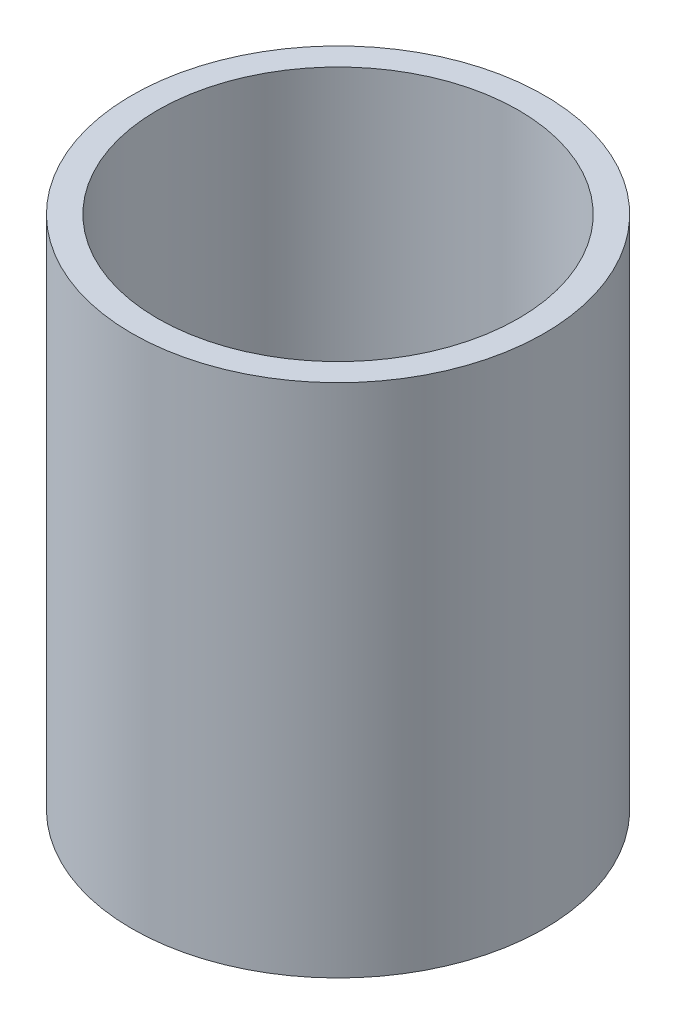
from build123d import *

# Parameters (mm, degrees)
SKETCH1_R      = 12.7
EXTRUDE1_DEPTH = 31.75
SKETCH2_R      = 11.1125
EXTRUDE2_DEPTH = 37.477972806


with BuildPart() as part:
    # Sketch1 → Extrude1 (new body)
    with BuildSketch(Plane(origin=(0, 0, 0), x_dir=(1, 0, 0), z_dir=(0, 1, 0))):
        with Locations(Location((0, 0, 0), (0, 0, 270))):
            Circle(SKETCH1_R)
    extrude(amount=EXTRUDE1_DEPTH)

    # Sketch2 → Extrude2 (cut, through all)
    with BuildSketch(Plane(origin=(0, 31.75, 0), x_dir=(1, 0, 0), z_dir=(0, 1, 0))):
        with Locations(Location((0, 0, 0), (0, 0, 270))):
            Circle(SKETCH2_R)
    extrude(amount=-EXTRUDE2_DEPTH, mode=Mode.SUBTRACT)


solid = part.part
